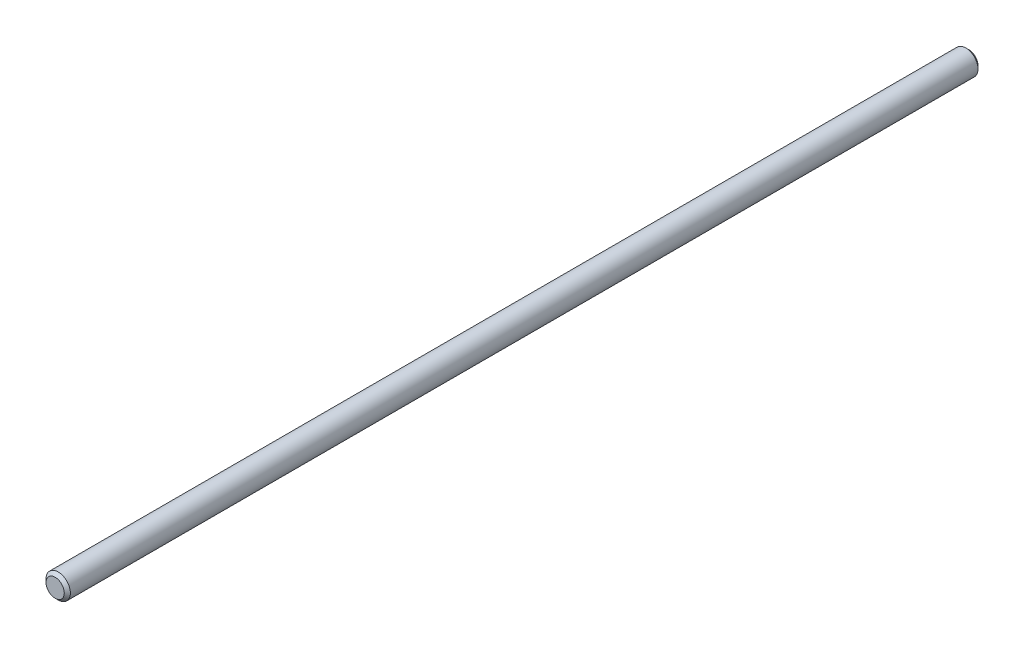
from build123d import *

# Parameters (mm, degrees)
SKETCH_1_R      = 2
EXTRUDE_1_DEPTH = 150
CHAMFER_1_SIZE  = 0.5


with BuildPart() as part:
    # Sketch 1 → Extrude 1 (new body)
    with BuildSketch(Plane.XY):
        Circle(SKETCH_1_R)
    extrude(amount=-EXTRUDE_1_DEPTH)

    # Chamfer 1
    chamfer_1_edges = [part.edges().sort_by_distance(p)[0] for p in [
        (-2, 0, 0),
        (-2, 0, -150),
    ]]
    chamfer(chamfer_1_edges, length=CHAMFER_1_SIZE)


solid = part.part
